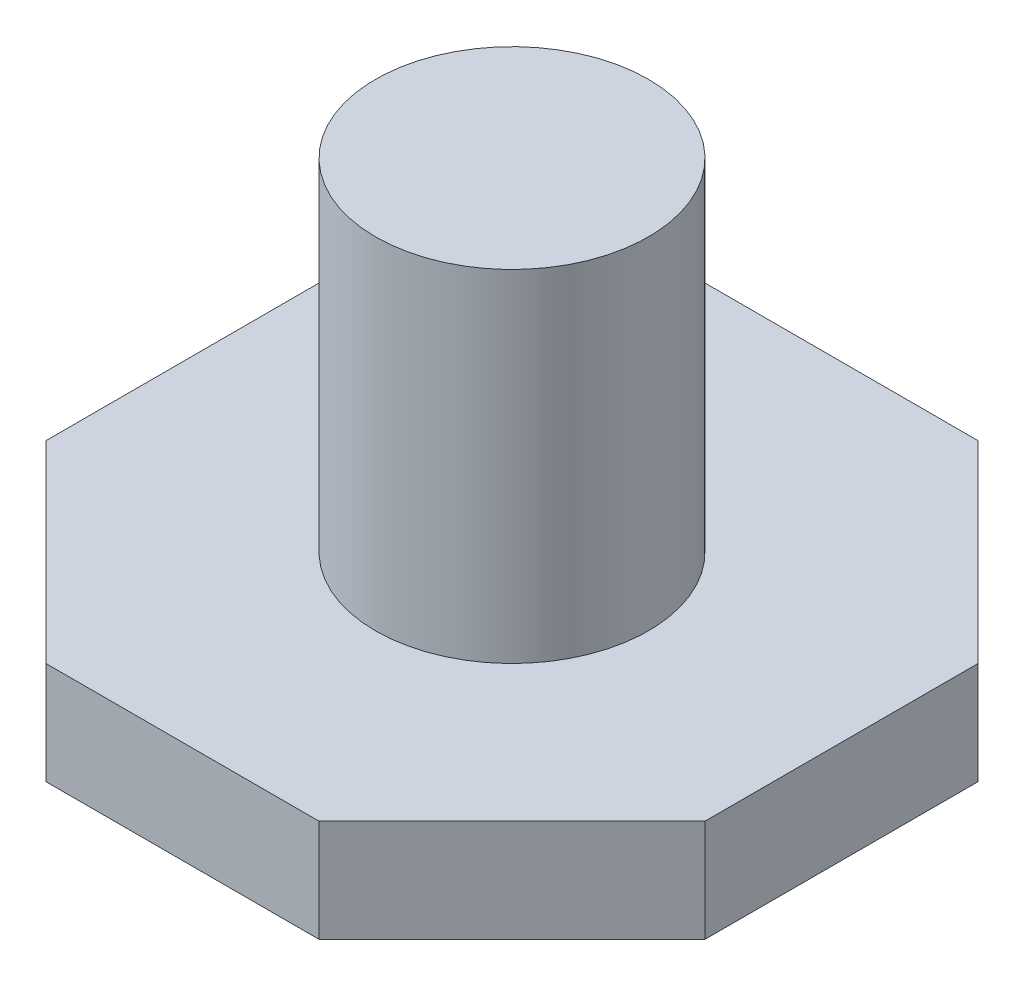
ISO-10303-21;
HEADER;
FILE_DESCRIPTION(('STEP AP214'),'2;1');
FILE_NAME('part.step','',(''),(''),'','','');
FILE_SCHEMA(('AUTOMOTIVE_DESIGN { 1 0 10303 214 1 1 1 1 }'));
ENDSEC;
DATA;
#1=APPLICATION_CONTEXT('core data for automotive mechanical design processes');
#2=APPLICATION_PROTOCOL_DEFINITION('international standard','automotive_design',2000,#1);
#3=PRODUCT_CONTEXT('',#1,'mechanical');
#4=PRODUCT('Part','Part','',(#3));
#5=PRODUCT_RELATED_PRODUCT_CATEGORY('part','',(#4));
#6=PRODUCT_DEFINITION_FORMATION('','',#4);
#7=PRODUCT_DEFINITION_CONTEXT('part definition',#1,'design');
#8=PRODUCT_DEFINITION('design','',#6,#7);
#9=PRODUCT_DEFINITION_SHAPE('','',#8);
#10=(LENGTH_UNIT() NAMED_UNIT(*) SI_UNIT(.MILLI.,.METRE.));
#11=(NAMED_UNIT(*) PLANE_ANGLE_UNIT() SI_UNIT($,.RADIAN.));
#12=(NAMED_UNIT(*) SI_UNIT($,.STERADIAN.) SOLID_ANGLE_UNIT());
#13=UNCERTAINTY_MEASURE_WITH_UNIT(LENGTH_MEASURE(1.E-05),#10,'distance_accuracy_value','');
#14=(GEOMETRIC_REPRESENTATION_CONTEXT(3) GLOBAL_UNCERTAINTY_ASSIGNED_CONTEXT((#13)) GLOBAL_UNIT_ASSIGNED_CONTEXT((#10,
#11,#12)) REPRESENTATION_CONTEXT('',''));
#15=CARTESIAN_POINT('',(0.,0.,0.));
#16=DIRECTION('',(0.,0.,1.));
#17=DIRECTION('',(1.,0.,0.));
#18=AXIS2_PLACEMENT_3D('',#15,#16,#17);
#19=CARTESIAN_POINT('',(2.,1.5,-4.82842712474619));
#20=DIRECTION('',(0.,0.,1.));
#21=DIRECTION('',(1.,0.,0.));
#22=AXIS2_PLACEMENT_3D('',#19,#20,#21);
#23=PLANE('',#22);
#24=DIRECTION('',(-1.,0.,0.));
#25=VECTOR('',#24,1.);
#26=CARTESIAN_POINT('',(2.,0.,-4.82842712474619));
#27=LINE('',#26,#25);
#28=CARTESIAN_POINT('',(2.,0.,-4.82842712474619));
#29=VERTEX_POINT('',#28);
#30=CARTESIAN_POINT('',(-2.,0.,-4.82842712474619));
#31=VERTEX_POINT('',#30);
#32=EDGE_CURVE('E146',#29,#31,#27,.T.);
#33=ORIENTED_EDGE('',*,*,#32,.T.);
#34=DIRECTION('',(0.,-1.,0.));
#35=VECTOR('',#34,1.);
#36=CARTESIAN_POINT('',(-2.,1.5,-4.82842712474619));
#37=LINE('',#36,#35);
#38=CARTESIAN_POINT('',(-2.,1.5,-4.82842712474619));
#39=VERTEX_POINT('',#38);
#40=EDGE_CURVE('E48',#39,#31,#37,.T.);
#41=ORIENTED_EDGE('',*,*,#40,.F.);
#42=DIRECTION('',(-1.,0.,0.));
#43=VECTOR('',#42,1.);
#44=CARTESIAN_POINT('',(2.,1.5,-4.82842712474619));
#45=LINE('',#44,#43);
#46=CARTESIAN_POINT('',(2.,1.5,-4.82842712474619));
#47=VERTEX_POINT('',#46);
#48=EDGE_CURVE('E173',#47,#39,#45,.T.);
#49=ORIENTED_EDGE('',*,*,#48,.F.);
#50=DIRECTION('',(0.,-1.,0.));
#51=VECTOR('',#50,1.);
#52=CARTESIAN_POINT('',(2.,1.5,-4.82842712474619));
#53=LINE('',#52,#51);
#54=EDGE_CURVE('E145',#47,#29,#53,.T.);
#55=ORIENTED_EDGE('',*,*,#54,.T.);
#56=EDGE_LOOP('',(#33,#41,#49,#55));
#57=FACE_BOUND('',#56,.T.);
#58=ADVANCED_FACE('F44',(#57),#23,.F.);
#59=CARTESIAN_POINT('',(-2.,1.5,-4.82842712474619));
#60=DIRECTION('',(0.707106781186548,0.,0.707106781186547));
#61=DIRECTION('',(0.707106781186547,0.,-0.707106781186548));
#62=AXIS2_PLACEMENT_3D('',#59,#60,#61);
#63=PLANE('',#62);
#64=DIRECTION('',(-0.707106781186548,0.,0.707106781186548));
#65=VECTOR('',#64,1.);
#66=CARTESIAN_POINT('',(-2.,0.,-4.82842712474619));
#67=LINE('',#66,#65);
#68=CARTESIAN_POINT('',(-4.82842712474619,0.,-2.));
#69=VERTEX_POINT('',#68);
#70=EDGE_CURVE('E155',#31,#69,#67,.T.);
#71=ORIENTED_EDGE('',*,*,#70,.T.);
#72=DIRECTION('',(0.,-1.,0.));
#73=VECTOR('',#72,1.);
#74=CARTESIAN_POINT('',(-4.82842712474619,1.5,-2.));
#75=LINE('',#74,#73);
#76=CARTESIAN_POINT('',(-4.82842712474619,1.5,-2.));
#77=VERTEX_POINT('',#76);
#78=EDGE_CURVE('E183',#77,#69,#75,.T.);
#79=ORIENTED_EDGE('',*,*,#78,.F.);
#80=DIRECTION('',(-0.707106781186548,0.,0.707106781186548));
#81=VECTOR('',#80,1.);
#82=CARTESIAN_POINT('',(-2.,1.5,-4.82842712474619));
#83=LINE('',#82,#81);
#84=EDGE_CURVE('E110',#39,#77,#83,.T.);
#85=ORIENTED_EDGE('',*,*,#84,.F.);
#86=ORIENTED_EDGE('',*,*,#40,.T.);
#87=EDGE_LOOP('',(#71,#79,#85,#86));
#88=FACE_BOUND('',#87,.T.);
#89=ADVANCED_FACE('F195',(#88),#63,.F.);
#90=CARTESIAN_POINT('',(-4.82842712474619,1.5,-2.));
#91=DIRECTION('',(1.,0.,0.));
#92=DIRECTION('',(0.,0.,-1.));
#93=AXIS2_PLACEMENT_3D('',#90,#91,#92);
#94=PLANE('',#93);
#95=DIRECTION('',(0.,0.,1.));
#96=VECTOR('',#95,1.);
#97=CARTESIAN_POINT('',(-4.82842712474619,0.,-2.));
#98=LINE('',#97,#96);
#99=CARTESIAN_POINT('',(-4.82842712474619,0.,2.));
#100=VERTEX_POINT('',#99);
#101=EDGE_CURVE('E156',#69,#100,#98,.T.);
#102=ORIENTED_EDGE('',*,*,#101,.T.);
#103=DIRECTION('',(0.,-1.,0.));
#104=VECTOR('',#103,1.);
#105=CARTESIAN_POINT('',(-4.82842712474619,1.5,2.));
#106=LINE('',#105,#104);
#107=CARTESIAN_POINT('',(-4.82842712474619,1.5,2.));
#108=VERTEX_POINT('',#107);
#109=EDGE_CURVE('E185',#108,#100,#106,.T.);
#110=ORIENTED_EDGE('',*,*,#109,.F.);
#111=DIRECTION('',(0.,0.,1.));
#112=VECTOR('',#111,1.);
#113=CARTESIAN_POINT('',(-4.82842712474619,1.5,-2.));
#114=LINE('',#113,#112);
#115=EDGE_CURVE('E207',#77,#108,#114,.T.);
#116=ORIENTED_EDGE('',*,*,#115,.F.);
#117=ORIENTED_EDGE('',*,*,#78,.T.);
#118=EDGE_LOOP('',(#102,#110,#116,#117));
#119=FACE_BOUND('',#118,.T.);
#120=ADVANCED_FACE('F205',(#119),#94,.F.);
#121=CARTESIAN_POINT('',(-4.82842712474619,1.5,2.));
#122=DIRECTION('',(0.707106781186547,0.,-0.707106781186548));
#123=DIRECTION('',(-0.707106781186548,0.,-0.707106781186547));
#124=AXIS2_PLACEMENT_3D('',#121,#122,#123);
#125=PLANE('',#124);
#126=DIRECTION('',(0.707106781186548,0.,0.707106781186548));
#127=VECTOR('',#126,1.);
#128=CARTESIAN_POINT('',(-4.82842712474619,0.,2.));
#129=LINE('',#128,#127);
#130=CARTESIAN_POINT('',(-2.,0.,4.82842712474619));
#131=VERTEX_POINT('',#130);
#132=EDGE_CURVE('E157',#100,#131,#129,.T.);
#133=ORIENTED_EDGE('',*,*,#132,.T.);
#134=DIRECTION('',(0.,-1.,0.));
#135=VECTOR('',#134,1.);
#136=CARTESIAN_POINT('',(-2.,1.5,4.82842712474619));
#137=LINE('',#136,#135);
#138=CARTESIAN_POINT('',(-2.,1.5,4.82842712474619));
#139=VERTEX_POINT('',#138);
#140=EDGE_CURVE('E180',#139,#131,#137,.T.);
#141=ORIENTED_EDGE('',*,*,#140,.F.);
#142=DIRECTION('',(0.707106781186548,0.,0.707106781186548));
#143=VECTOR('',#142,1.);
#144=CARTESIAN_POINT('',(-4.82842712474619,1.5,2.));
#145=LINE('',#144,#143);
#146=EDGE_CURVE('E210',#108,#139,#145,.T.);
#147=ORIENTED_EDGE('',*,*,#146,.F.);
#148=ORIENTED_EDGE('',*,*,#109,.T.);
#149=EDGE_LOOP('',(#133,#141,#147,#148));
#150=FACE_BOUND('',#149,.T.);
#151=ADVANCED_FACE('F202',(#150),#125,.F.);
#152=CARTESIAN_POINT('',(-2.,1.5,4.82842712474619));
#153=DIRECTION('',(0.,0.,-1.));
#154=DIRECTION('',(-1.,0.,0.));
#155=AXIS2_PLACEMENT_3D('',#152,#153,#154);
#156=PLANE('',#155);
#157=DIRECTION('',(1.,0.,0.));
#158=VECTOR('',#157,1.);
#159=CARTESIAN_POINT('',(-2.,0.,4.82842712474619));
#160=LINE('',#159,#158);
#161=CARTESIAN_POINT('',(2.,0.,4.82842712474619));
#162=VERTEX_POINT('',#161);
#163=EDGE_CURVE('E165',#131,#162,#160,.T.);
#164=ORIENTED_EDGE('',*,*,#163,.T.);
#165=DIRECTION('',(0.,-1.,0.));
#166=VECTOR('',#165,1.);
#167=CARTESIAN_POINT('',(2.,1.5,4.82842712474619));
#168=LINE('',#167,#166);
#169=CARTESIAN_POINT('',(2.,1.5,4.82842712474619));
#170=VERTEX_POINT('',#169);
#171=EDGE_CURVE('E136',#170,#162,#168,.T.);
#172=ORIENTED_EDGE('',*,*,#171,.F.);
#173=DIRECTION('',(1.,0.,0.));
#174=VECTOR('',#173,1.);
#175=CARTESIAN_POINT('',(-2.,1.5,4.82842712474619));
#176=LINE('',#175,#174);
#177=EDGE_CURVE('E127',#139,#170,#176,.T.);
#178=ORIENTED_EDGE('',*,*,#177,.F.);
#179=ORIENTED_EDGE('',*,*,#140,.T.);
#180=EDGE_LOOP('',(#164,#172,#178,#179));
#181=FACE_BOUND('',#180,.T.);
#182=ADVANCED_FACE('F253',(#181),#156,.F.);
#183=CARTESIAN_POINT('',(2.,1.5,4.82842712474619));
#184=DIRECTION('',(-0.707106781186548,0.,-0.707106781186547));
#185=DIRECTION('',(-0.707106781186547,0.,0.707106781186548));
#186=AXIS2_PLACEMENT_3D('',#183,#184,#185);
#187=PLANE('',#186);
#188=DIRECTION('',(0.707106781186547,0.,-0.707106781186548));
#189=VECTOR('',#188,1.);
#190=CARTESIAN_POINT('',(2.,0.,4.82842712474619));
#191=LINE('',#190,#189);
#192=CARTESIAN_POINT('',(4.82842712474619,0.,2.));
#193=VERTEX_POINT('',#192);
#194=EDGE_CURVE('E131',#162,#193,#191,.T.);
#195=ORIENTED_EDGE('',*,*,#194,.T.);
#196=DIRECTION('',(0.,-1.,0.));
#197=VECTOR('',#196,1.);
#198=CARTESIAN_POINT('',(4.82842712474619,1.5,2.));
#199=LINE('',#198,#197);
#200=CARTESIAN_POINT('',(4.82842712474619,1.5,2.));
#201=VERTEX_POINT('',#200);
#202=EDGE_CURVE('E134',#201,#193,#199,.T.);
#203=ORIENTED_EDGE('',*,*,#202,.F.);
#204=DIRECTION('',(0.707106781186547,0.,-0.707106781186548));
#205=VECTOR('',#204,1.);
#206=CARTESIAN_POINT('',(2.,1.5,4.82842712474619));
#207=LINE('',#206,#205);
#208=EDGE_CURVE('E116',#170,#201,#207,.T.);
#209=ORIENTED_EDGE('',*,*,#208,.F.);
#210=ORIENTED_EDGE('',*,*,#171,.T.);
#211=EDGE_LOOP('',(#195,#203,#209,#210));
#212=FACE_BOUND('',#211,.T.);
#213=ADVANCED_FACE('F132',(#212),#187,.F.);
#214=CARTESIAN_POINT('',(4.82842712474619,1.5,2.));
#215=DIRECTION('',(-1.,0.,0.));
#216=DIRECTION('',(0.,0.,1.));
#217=AXIS2_PLACEMENT_3D('',#214,#215,#216);
#218=PLANE('',#217);
#219=DIRECTION('',(0.,0.,-1.));
#220=VECTOR('',#219,1.);
#221=CARTESIAN_POINT('',(4.82842712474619,0.,2.));
#222=LINE('',#221,#220);
#223=CARTESIAN_POINT('',(4.82842712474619,0.,-2.));
#224=VERTEX_POINT('',#223);
#225=EDGE_CURVE('E95',#193,#224,#222,.T.);
#226=ORIENTED_EDGE('',*,*,#225,.T.);
#227=DIRECTION('',(0.,-1.,0.));
#228=VECTOR('',#227,1.);
#229=CARTESIAN_POINT('',(4.82842712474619,1.5,-2.));
#230=LINE('',#229,#228);
#231=CARTESIAN_POINT('',(4.82842712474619,1.5,-2.));
#232=VERTEX_POINT('',#231);
#233=EDGE_CURVE('E140',#232,#224,#230,.T.);
#234=ORIENTED_EDGE('',*,*,#233,.F.);
#235=DIRECTION('',(0.,0.,-1.));
#236=VECTOR('',#235,1.);
#237=CARTESIAN_POINT('',(4.82842712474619,1.5,2.));
#238=LINE('',#237,#236);
#239=EDGE_CURVE('E123',#201,#232,#238,.T.);
#240=ORIENTED_EDGE('',*,*,#239,.F.);
#241=ORIENTED_EDGE('',*,*,#202,.T.);
#242=EDGE_LOOP('',(#226,#234,#240,#241));
#243=FACE_BOUND('',#242,.T.);
#244=ADVANCED_FACE('F137',(#243),#218,.F.);
#245=CARTESIAN_POINT('',(4.82842712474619,1.5,-2.));
#246=DIRECTION('',(-0.707106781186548,0.,0.707106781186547));
#247=DIRECTION('',(0.707106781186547,0.,0.707106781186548));
#248=AXIS2_PLACEMENT_3D('',#245,#246,#247);
#249=PLANE('',#248);
#250=DIRECTION('',(-0.707106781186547,0.,-0.707106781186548));
#251=VECTOR('',#250,1.);
#252=CARTESIAN_POINT('',(4.82842712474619,0.,-2.));
#253=LINE('',#252,#251);
#254=EDGE_CURVE('E98',#224,#29,#253,.T.);
#255=ORIENTED_EDGE('',*,*,#254,.T.);
#256=ORIENTED_EDGE('',*,*,#54,.F.);
#257=DIRECTION('',(-0.707106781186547,0.,-0.707106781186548));
#258=VECTOR('',#257,1.);
#259=CARTESIAN_POINT('',(4.82842712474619,1.5,-2.));
#260=LINE('',#259,#258);
#261=EDGE_CURVE('E62',#232,#47,#260,.T.);
#262=ORIENTED_EDGE('',*,*,#261,.F.);
#263=ORIENTED_EDGE('',*,*,#233,.T.);
#264=EDGE_LOOP('',(#255,#256,#262,#263));
#265=FACE_BOUND('',#264,.T.);
#266=ADVANCED_FACE('F231',(#265),#249,.F.);
#267=CARTESIAN_POINT('',(0.,1.5,0.));
#268=DIRECTION('',(0.,1.,0.));
#269=DIRECTION('',(0.,0.,1.));
#270=AXIS2_PLACEMENT_3D('',#267,#268,#269);
#271=PLANE('',#270);
#272=CARTESIAN_POINT('',(0.,1.5,0.));
#273=DIRECTION('',(0.,1.,0.));
#274=DIRECTION('',(0.,0.,1.));
#275=AXIS2_PLACEMENT_3D('',#272,#273,#274);
#276=CIRCLE('',#275,2.);
#277=CARTESIAN_POINT('',(0.,1.5,2.));
#278=VERTEX_POINT('',#277);
#279=EDGE_CURVE('E11',#278,#278,#276,.T.);
#280=ORIENTED_EDGE('',*,*,#279,.F.);
#281=EDGE_LOOP('',(#280));
#282=FACE_BOUND('',#281,.T.);
#283=ORIENTED_EDGE('',*,*,#48,.T.);
#284=ORIENTED_EDGE('',*,*,#84,.T.);
#285=ORIENTED_EDGE('',*,*,#115,.T.);
#286=ORIENTED_EDGE('',*,*,#146,.T.);
#287=ORIENTED_EDGE('',*,*,#177,.T.);
#288=ORIENTED_EDGE('',*,*,#208,.T.);
#289=ORIENTED_EDGE('',*,*,#239,.T.);
#290=ORIENTED_EDGE('',*,*,#261,.T.);
#291=EDGE_LOOP('',(#283,#284,#285,#286,#287,#288,#289,#290));
#292=FACE_BOUND('',#291,.T.);
#293=ADVANCED_FACE('F121',(#282,#292),#271,.T.);
#294=CARTESIAN_POINT('',(0.,0.,0.));
#295=DIRECTION('',(0.,1.,0.));
#296=DIRECTION('',(0.,0.,1.));
#297=AXIS2_PLACEMENT_3D('',#294,#295,#296);
#298=PLANE('',#297);
#299=ORIENTED_EDGE('',*,*,#32,.F.);
#300=ORIENTED_EDGE('',*,*,#254,.F.);
#301=ORIENTED_EDGE('',*,*,#225,.F.);
#302=ORIENTED_EDGE('',*,*,#194,.F.);
#303=ORIENTED_EDGE('',*,*,#163,.F.);
#304=ORIENTED_EDGE('',*,*,#132,.F.);
#305=ORIENTED_EDGE('',*,*,#101,.F.);
#306=ORIENTED_EDGE('',*,*,#70,.F.);
#307=EDGE_LOOP('',(#299,#300,#301,#302,#303,#304,#305,#306));
#308=FACE_BOUND('',#307,.T.);
#309=ADVANCED_FACE('F196',(#308),#298,.F.);
#310=CARTESIAN_POINT('',(0.,6.5,0.));
#311=DIRECTION('',(0.,-1.,0.));
#312=DIRECTION('',(0.,0.,-1.));
#313=AXIS2_PLACEMENT_3D('',#310,#311,#312);
#314=CYLINDRICAL_SURFACE('',#313,2.);
#315=CARTESIAN_POINT('',(0.,6.5,0.));
#316=DIRECTION('',(0.,1.,0.));
#317=DIRECTION('',(0.,0.,1.));
#318=AXIS2_PLACEMENT_3D('',#315,#316,#317);
#319=CIRCLE('',#318,2.);
#320=CARTESIAN_POINT('',(0.,6.5,2.));
#321=VERTEX_POINT('',#320);
#322=EDGE_CURVE('E153',#321,#321,#319,.T.);
#323=ORIENTED_EDGE('',*,*,#322,.F.);
#324=EDGE_LOOP('',(#323));
#325=FACE_BOUND('',#324,.T.);
#326=ORIENTED_EDGE('',*,*,#279,.T.);
#327=EDGE_LOOP('',(#326));
#328=FACE_BOUND('',#327,.T.);
#329=ADVANCED_FACE('F223',(#325,#328),#314,.T.);
#330=CARTESIAN_POINT('',(0.,6.5,0.));
#331=DIRECTION('',(0.,1.,0.));
#332=DIRECTION('',(0.,0.,1.));
#333=AXIS2_PLACEMENT_3D('',#330,#331,#332);
#334=PLANE('',#333);
#335=ORIENTED_EDGE('',*,*,#322,.T.);
#336=EDGE_LOOP('',(#335));
#337=FACE_BOUND('',#336,.T.);
#338=ADVANCED_FACE('F224',(#337),#334,.T.);
#339=CLOSED_SHELL('',(#58,#89,#120,#151,#182,#213,#244,#266,#293,#309,#329,#338));
#340=MANIFOLD_SOLID_BREP('B2',#339);
#341=ADVANCED_BREP_SHAPE_REPRESENTATION('',(#18,#340),#14);
#342=SHAPE_DEFINITION_REPRESENTATION(#9,#341);
ENDSEC;
END-ISO-10303-21;
